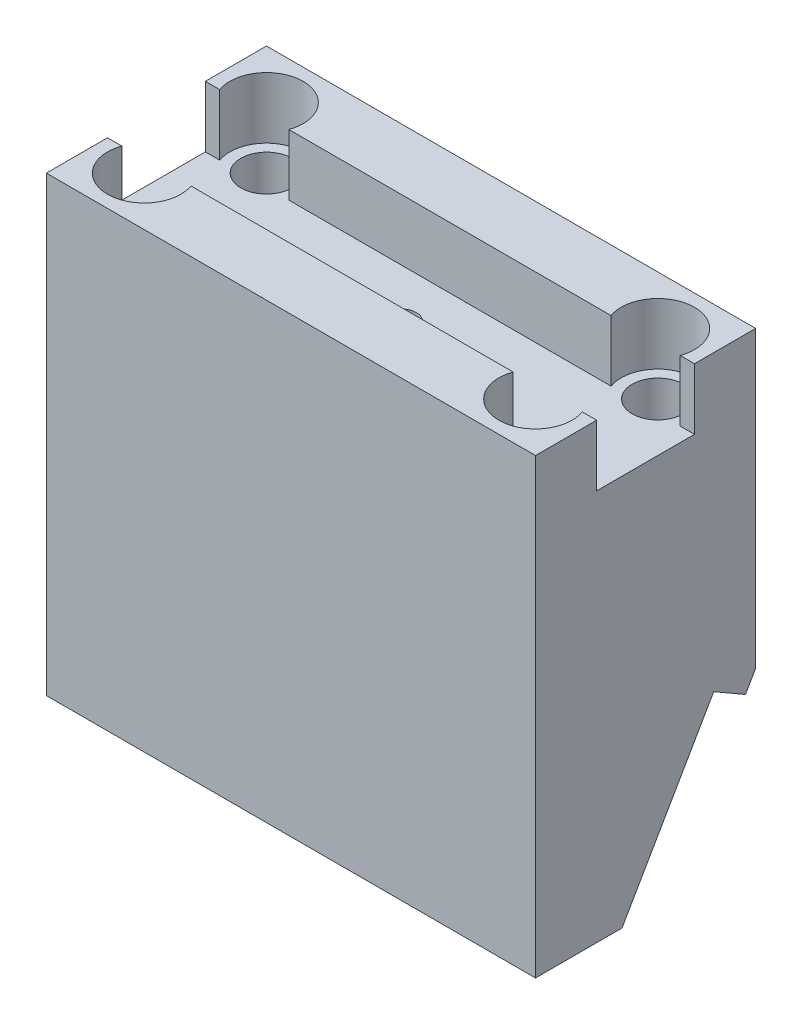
from build123d import *

# Parameters (mm, degrees)
EXTRUSION1_DEPTH                = 40
ESQUISSE11_R                    = 3
EXTRUSION5_DEPTH                = 5
R_P_TITION_LIN_AIRE1_COUNT      = 2
R_P_TITION_LIN_AIRE1_PITCH      = 10
R_P_TITION_LIN_AIRE1_COUNT_DIR2 = 2
R_P_TITION_LIN_AIRE1_PITCH_DIR2 = 32
ESQUISSE5_W                     = 59.416289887
ESQUISSE5_H                     = 8
EXTRUSION2_DEPTH                = 5
EXTRUSION3_DEPTH                = 58.384666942
TROU_TARAUD_M32_D               = 2.5
TROU_TARAUD_M32_DEPTH           = 7.5
TROU_TARAUD_M32_TIP             = 0.751075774
TROU_TARAUD_M32_ON_FACE_2_D     = 2.5
TROU_TARAUD_M32_ON_FACE_2_DEPTH = 7.5
TROU_TARAUD_M32_ON_FACE_2_TIP   = 0.751075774
TROU_TARAUD_M31_D               = 2.5
TROU_TARAUD_M31_DEPTH           = 13
TROU_TARAUD_M31_TIP             = 0.751075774


with BuildPart() as part:
    # Esquisse2 → Extrusion1 (new body)
    with BuildSketch(Plane(origin=(0, 0, 0), x_dir=(0, 0, -1), z_dir=(1, 0, 0))):
        Polygon((0, 0), (10.535898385, 0), (18, 12.92820323), (18, 37), (0, 37), align=None)
    extrude(amount=EXTRUSION1_DEPTH)

    # Esquisse3 → Trou taraud_ M51 (revolve, cut)
    with BuildSketch(Plane(origin=(4, 37, -4), x_dir=(0, 0, 1), z_dir=(1, 0, 0))):
        Polygon((0, 0), (0, 16.6618073), (2.1, 15.4), (2.1, 0), align=None)
    trou_taraud_m51 = revolve(axis=Axis((4, 43.35, -4), (0, -1, 0)), mode=Mode.SUBTRACT)

    # Esquisse11 → Extrusion5 (cut)
    with BuildSketch(Plane(origin=(0, 37, 0), x_dir=(-1, 0, 0), z_dir=(0, 1, 0))):
        with Locations(Location((-4, -4, 0), (0, 0, 90))):
            Circle(ESQUISSE11_R)
    extrusion5 = extrude(amount=-EXTRUSION5_DEPTH, mode=Mode.SUBTRACT)

    # R_p_tition lin_aire1: Trou taraud_ M51, Extrusion5 2 × 2
    with Locations(*[(j * R_P_TITION_LIN_AIRE1_PITCH_DIR2, 0, -i * R_P_TITION_LIN_AIRE1_PITCH) for i in range(R_P_TITION_LIN_AIRE1_COUNT) for j in range(R_P_TITION_LIN_AIRE1_COUNT_DIR2) if (i, j) != (0, 0)]):
        add(trou_taraud_m51, mode=Mode.SUBTRACT)
        add(extrusion5, mode=Mode.SUBTRACT)

    # Esquisse5 → Extrusion2 (cut)
    with BuildSketch(Plane(origin=(0, 37, 0), x_dir=(1, 0, 0), z_dir=(0, 1, 0))):
        with Locations((17.438798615, 9)):
            Rectangle(ESQUISSE5_W, ESQUISSE5_H)
    extrude(amount=-EXTRUSION2_DEPTH, mode=Mode.SUBTRACT)

    # Esquisse6 → Extrusion3 (cut, through all)
    with BuildSketch(Plane.ZY):
        Polygon((-14.57179677, 12.990381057), (-6.11803531, -1.651963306), (-31.324128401, -16.204707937), (-39.77788986, -1.562363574), align=None)
    extrude(amount=-EXTRUSION3_DEPTH, mode=Mode.SUBTRACT)

    # Trou taraud_ M32
    with Locations(Plane(origin=(10, 6.495190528, -10.82179677), x_dir=(0, -0.866025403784, 0.5), z_dir=(0, -0.5, -0.866025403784))):
        with Locations((0, 0)):
            Hole(TROU_TARAUD_M32_D / 2, depth=TROU_TARAUD_M32_DEPTH)
            with Locations((0, 0, -(TROU_TARAUD_M32_DEPTH + TROU_TARAUD_M32_TIP / 2))):  # 118° drill point
                Cone(0, TROU_TARAUD_M32_D / 2, TROU_TARAUD_M32_TIP, mode=Mode.SUBTRACT)

    # Trou taraud_ M32 on face 2
    with Locations(Plane(origin=(30, 6.495190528, -10.82179677), x_dir=(0, -0.866025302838, 0.500000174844), z_dir=(0, -0.500000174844, -0.866025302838))):
        with Locations((0, 0)):
            Hole(TROU_TARAUD_M32_ON_FACE_2_D / 2, depth=TROU_TARAUD_M32_ON_FACE_2_DEPTH)
            with Locations((0, 0, -(TROU_TARAUD_M32_ON_FACE_2_DEPTH + TROU_TARAUD_M32_ON_FACE_2_TIP / 2))):  # 118° drill point
                Cone(0, TROU_TARAUD_M32_ON_FACE_2_D / 2, TROU_TARAUD_M32_ON_FACE_2_TIP, mode=Mode.SUBTRACT)

    # Trou taraud_ M31
    with Locations(Plane(origin=(20, 32, -9), x_dir=(0, 0, 1), z_dir=(0, 1, 0))):
        with Locations((0, 0)):
            Hole(TROU_TARAUD_M31_D / 2, depth=TROU_TARAUD_M31_DEPTH)
            with Locations((0, 0, -(TROU_TARAUD_M31_DEPTH + TROU_TARAUD_M31_TIP / 2))):  # 118° drill point
                Cone(0, TROU_TARAUD_M31_D / 2, TROU_TARAUD_M31_TIP, mode=Mode.SUBTRACT)


solid = part.part
